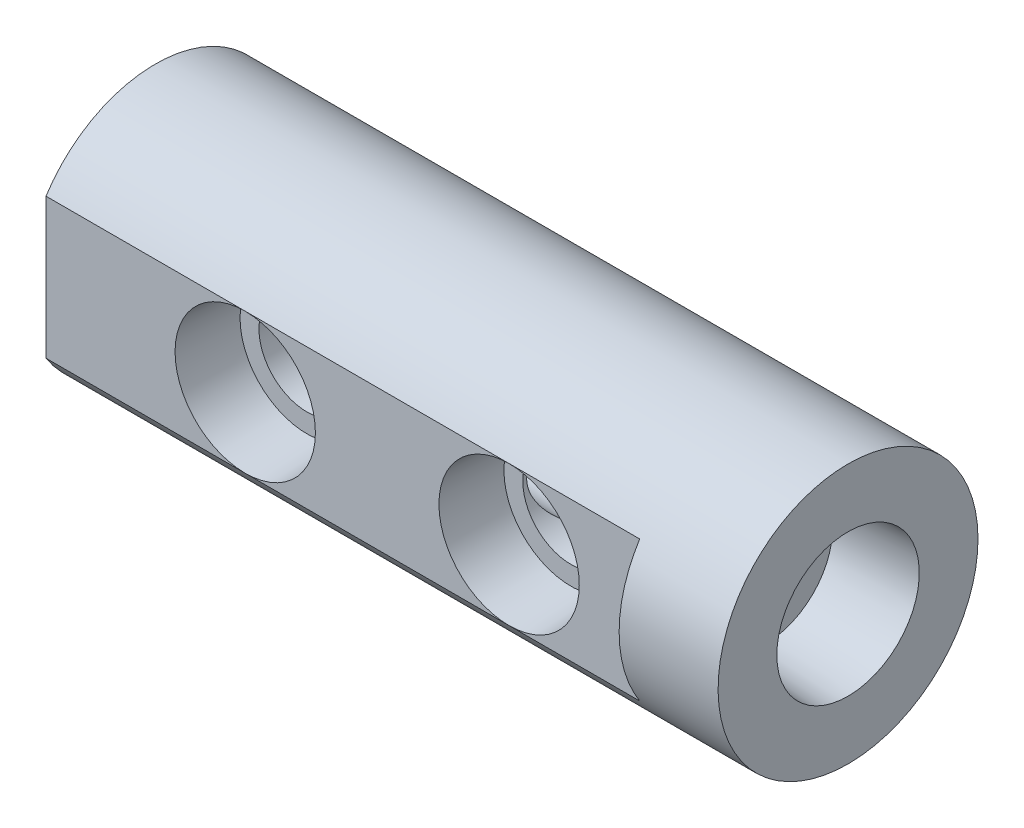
ISO-10303-21;
HEADER;
FILE_DESCRIPTION(('STEP AP214'),'2;1');
FILE_NAME('part.step','',(''),(''),'','','');
FILE_SCHEMA(('AUTOMOTIVE_DESIGN { 1 0 10303 214 1 1 1 1 }'));
ENDSEC;
DATA;
#1=APPLICATION_CONTEXT('core data for automotive mechanical design processes');
#2=APPLICATION_PROTOCOL_DEFINITION('international standard','automotive_design',2000,#1);
#3=PRODUCT_CONTEXT('',#1,'mechanical');
#4=PRODUCT('Part','Part','',(#3));
#5=PRODUCT_RELATED_PRODUCT_CATEGORY('part','',(#4));
#6=PRODUCT_DEFINITION_FORMATION('','',#4);
#7=PRODUCT_DEFINITION_CONTEXT('part definition',#1,'design');
#8=PRODUCT_DEFINITION('design','',#6,#7);
#9=PRODUCT_DEFINITION_SHAPE('','',#8);
#10=(LENGTH_UNIT() NAMED_UNIT(*) SI_UNIT(.MILLI.,.METRE.));
#11=(NAMED_UNIT(*) PLANE_ANGLE_UNIT() SI_UNIT($,.RADIAN.));
#12=(NAMED_UNIT(*) SI_UNIT($,.STERADIAN.) SOLID_ANGLE_UNIT());
#13=UNCERTAINTY_MEASURE_WITH_UNIT(LENGTH_MEASURE(1.E-05),#10,'distance_accuracy_value','');
#14=(GEOMETRIC_REPRESENTATION_CONTEXT(3) GLOBAL_UNCERTAINTY_ASSIGNED_CONTEXT((#13)) GLOBAL_UNIT_ASSIGNED_CONTEXT((#10,
#11,#12)) REPRESENTATION_CONTEXT('',''));
#15=CARTESIAN_POINT('',(0.,0.,0.));
#16=DIRECTION('',(0.,0.,1.));
#17=DIRECTION('',(1.,0.,0.));
#18=AXIS2_PLACEMENT_3D('',#15,#16,#17);
#19=CARTESIAN_POINT('',(44.577,0.,17.0942));
#20=DIRECTION('',(0.,0.,-1.));
#21=DIRECTION('',(-1.,0.,0.));
#22=AXIS2_PLACEMENT_3D('',#19,#20,#21);
#23=CYLINDRICAL_SURFACE('',#22,4.6228);
#24=CARTESIAN_POINT('',(44.577,0.,17.0942));
#25=DIRECTION('',(0.,0.,-1.));
#26=DIRECTION('',(-1.,0.,0.));
#27=AXIS2_PLACEMENT_3D('',#24,#25,#26);
#28=CIRCLE('',#27,4.6228);
#29=CARTESIAN_POINT('',(39.9542,0.,17.0942));
#30=VERTEX_POINT('',#29);
#31=EDGE_CURVE('E204',#30,#30,#28,.T.);
#32=ORIENTED_EDGE('',*,*,#31,.F.);
#33=EDGE_LOOP('',(#32));
#34=FACE_BOUND('',#33,.T.);
#35=CARTESIAN_POINT('',(44.577,0.,5.46297482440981));
#36=DIRECTION('',(0.,0.,-1.));
#37=DIRECTION('',(-1.,0.,0.));
#38=AXIS2_PLACEMENT_3D('',#35,#36,#37);
#39=CIRCLE('',#38,4.6228);
#40=CARTESIAN_POINT('',(39.9542,0.,5.46297482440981));
#41=VERTEX_POINT('',#40);
#42=EDGE_CURVE('E201',#41,#41,#39,.T.);
#43=ORIENTED_EDGE('',*,*,#42,.T.);
#44=EDGE_LOOP('',(#43));
#45=FACE_BOUND('',#44,.T.);
#46=CARTESIAN_POINT('',(49.1998,0.,16.4719));
#47=CARTESIAN_POINT('',(49.1998041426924,-0.0933276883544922,16.4719042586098));
#48=CARTESIAN_POINT('',(49.1969702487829,-0.186622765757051,16.468599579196));
#49=CARTESIAN_POINT('',(49.1857114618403,-0.372441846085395,16.4554558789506));
#50=CARTESIAN_POINT('',(49.177285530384,-0.464965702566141,16.4456156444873));
#51=CARTESIAN_POINT('',(49.1550211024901,-0.648500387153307,16.4195712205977));
#52=CARTESIAN_POINT('',(49.1411796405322,-0.739510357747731,16.4033635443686));
#53=CARTESIAN_POINT('',(49.1083918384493,-0.919314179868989,16.364878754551));
#54=CARTESIAN_POINT('',(49.089443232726,-1.00810702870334,16.3425989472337));
#55=CARTESIAN_POINT('',(49.0257650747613,-1.26909209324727,16.267499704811));
#56=CARTESIAN_POINT('',(48.9740299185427,-1.43725022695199,16.2062200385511));
#57=CARTESIAN_POINT('',(48.8554464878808,-1.75918975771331,16.0643471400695));
#58=CARTESIAN_POINT('',(48.7885932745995,-1.91296643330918,15.9837475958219));
#59=CARTESIAN_POINT('',(48.6157784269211,-2.26031069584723,15.7724916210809));
#60=CARTESIAN_POINT('',(48.5046014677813,-2.44684451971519,15.6344447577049));
#61=CARTESIAN_POINT('',(48.3283802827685,-2.70338765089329,15.4087027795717));
#62=CARTESIAN_POINT('',(48.2679458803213,-2.78515259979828,15.3301843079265));
#63=CARTESIAN_POINT('',(48.1450251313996,-2.94096818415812,15.1673187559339));
#64=CARTESIAN_POINT('',(48.0825395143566,-3.01502152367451,15.0829737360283));
#65=CARTESIAN_POINT('',(47.955418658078,-3.15686985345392,14.9069635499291));
#66=CARTESIAN_POINT('',(47.8907655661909,-3.22450645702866,14.8151841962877));
#67=CARTESIAN_POINT('',(47.7619422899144,-3.35180828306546,14.6258673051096));
#68=CARTESIAN_POINT('',(47.6977722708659,-3.41147088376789,14.5283278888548));
#69=CARTESIAN_POINT('',(47.5718027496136,-3.52256557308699,14.3275449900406));
#70=CARTESIAN_POINT('',(47.5099985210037,-3.57401480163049,14.2243140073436));
#71=CARTESIAN_POINT('',(47.3909463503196,-3.66848090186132,14.0116272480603));
#72=CARTESIAN_POINT('',(47.3336947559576,-3.71150457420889,13.9021765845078));
#73=CARTESIAN_POINT('',(47.2238333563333,-3.79069612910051,13.6701518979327));
#74=CARTESIAN_POINT('',(47.171663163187,-3.82634502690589,13.5471861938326));
#75=CARTESIAN_POINT('',(47.0811127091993,-3.88621640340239,13.2935853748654));
#76=CARTESIAN_POINT('',(47.0427042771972,-3.91046225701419,13.1629665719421));
#77=CARTESIAN_POINT('',(46.9997205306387,-3.93712986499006,12.961525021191));
#78=CARTESIAN_POINT('',(46.9877956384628,-3.94442053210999,12.8928836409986));
#79=CARTESIAN_POINT('',(46.9697060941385,-3.95542063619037,12.7545784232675));
#80=CARTESIAN_POINT('',(46.9635381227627,-3.95913213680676,12.6849151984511));
#81=CARTESIAN_POINT('',(46.9573537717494,-3.96285378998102,12.5452577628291));
#82=CARTESIAN_POINT('',(46.9573333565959,-3.96286637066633,12.4752637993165));
#83=CARTESIAN_POINT('',(46.9634224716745,-3.95920143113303,12.3356574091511));
#84=CARTESIAN_POINT('',(46.9695319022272,-3.95552397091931,12.2660449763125));
#85=CARTESIAN_POINT('',(46.9937528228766,-3.94080234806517,12.0800874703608));
#86=CARTESIAN_POINT('',(47.0172399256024,-3.92642414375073,11.9646793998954));
#87=CARTESIAN_POINT('',(47.0773068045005,-3.88844100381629,11.7388974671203));
#88=CARTESIAN_POINT('',(47.1139096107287,-3.86481983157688,11.6285328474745));
#89=CARTESIAN_POINT('',(47.1927368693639,-3.81185731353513,11.4229364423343));
#90=CARTESIAN_POINT('',(47.2341920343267,-3.78319499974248,11.3272245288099));
#91=CARTESIAN_POINT('',(47.3224268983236,-3.71965965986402,11.1403784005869));
#92=CARTESIAN_POINT('',(47.3692107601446,-3.68478176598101,11.049247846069));
#93=CARTESIAN_POINT('',(47.4663386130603,-3.60912775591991,10.8711494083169));
#94=CARTESIAN_POINT('',(47.516690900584,-3.56833764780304,10.7841920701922));
#95=CARTESIAN_POINT('',(47.6194276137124,-3.48115718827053,10.6144381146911));
#96=CARTESIAN_POINT('',(47.671811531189,-3.4347682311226,10.5316404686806));
#97=CARTESIAN_POINT('',(47.7818006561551,-3.33250886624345,10.3634688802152));
#98=CARTESIAN_POINT('',(47.8394855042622,-3.27617506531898,10.2784281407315));
#99=CARTESIAN_POINT('',(47.9548345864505,-3.15711868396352,10.1129173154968));
#100=CARTESIAN_POINT('',(48.0124988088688,-3.09439415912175,10.0324486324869));
#101=CARTESIAN_POINT('',(48.1838403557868,-2.8967733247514,9.79821993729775));
#102=CARTESIAN_POINT('',(48.2960855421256,-2.75223321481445,9.6513136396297));
#103=CARTESIAN_POINT('',(48.5042419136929,-2.4453508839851,9.38540526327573));
#104=CARTESIAN_POINT('',(48.6006912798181,-2.28427348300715,9.26536980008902));
#105=CARTESIAN_POINT('',(48.7777653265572,-1.93940182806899,9.04818299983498));
#106=CARTESIAN_POINT('',(48.8584051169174,-1.75562954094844,8.95100979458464));
#107=CARTESIAN_POINT('',(48.9852596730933,-1.40224347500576,8.79944967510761));
#108=CARTESIAN_POINT('',(49.0350394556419,-1.23586512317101,8.74053656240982));
#109=CARTESIAN_POINT('',(49.1162338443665,-0.892559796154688,8.64483635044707));
#110=CARTESIAN_POINT('',(49.1476619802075,-0.715640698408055,8.60803295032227));
#111=CARTESIAN_POINT('',(49.1897259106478,-0.35510981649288,8.55883683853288));
#112=CARTESIAN_POINT('',(49.2002662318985,-0.171471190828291,8.54655621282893));
#113=CARTESIAN_POINT('',(49.1993020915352,0.195673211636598,8.54768074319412));
#114=CARTESIAN_POINT('',(49.1877985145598,0.379178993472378,8.56108486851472));
#115=CARTESIAN_POINT('',(49.1454219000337,0.726803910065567,8.61065923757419));
#116=CARTESIAN_POINT('',(49.1160235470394,0.891360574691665,8.6450968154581));
#117=CARTESIAN_POINT('',(49.0412844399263,1.21139111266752,8.73316432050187));
#118=CARTESIAN_POINT('',(48.9959411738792,1.3668635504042,8.78679727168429));
#119=CARTESIAN_POINT('',(48.8877912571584,1.67830627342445,8.9158120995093));
#120=CARTESIAN_POINT('',(48.8238669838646,1.83329539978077,8.99260450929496));
#121=CARTESIAN_POINT('',(48.6840860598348,2.12809172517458,9.16273268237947));
#122=CARTESIAN_POINT('',(48.6082202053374,2.26788707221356,9.25608121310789));
#123=CARTESIAN_POINT('',(48.4679129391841,2.49891198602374,9.43190329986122));
#124=CARTESIAN_POINT('',(48.4052885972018,2.59360032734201,9.51135379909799));
#125=CARTESIAN_POINT('',(48.2766701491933,2.77398353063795,9.67742334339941));
#126=CARTESIAN_POINT('',(48.2106758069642,2.85967776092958,9.76404289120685));
#127=CARTESIAN_POINT('',(48.0766068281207,3.0222775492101,9.94411377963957));
#128=CARTESIAN_POINT('',(48.0085278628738,3.09916299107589,10.0375799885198));
#129=CARTESIAN_POINT('',(47.871986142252,3.2439536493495,10.2309120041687));
#130=CARTESIAN_POINT('',(47.8035235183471,3.31186176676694,10.3307757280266));
#131=CARTESIAN_POINT('',(47.6835266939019,3.42416389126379,10.5133971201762));
#132=CARTESIAN_POINT('',(47.631700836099,3.47038424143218,10.5948456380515));
#133=CARTESIAN_POINT('',(47.5299552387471,3.55735990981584,10.7617416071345));
#134=CARTESIAN_POINT('',(47.4800350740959,3.59811645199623,10.8471881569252));
#135=CARTESIAN_POINT('',(47.3835258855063,3.67388691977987,11.0221416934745));
#136=CARTESIAN_POINT('',(47.3369295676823,3.70891365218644,11.1116390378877));
#137=CARTESIAN_POINT('',(47.2487089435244,3.77295927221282,11.2950760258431));
#138=CARTESIAN_POINT('',(47.2070815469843,3.80198190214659,11.3890128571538));
#139=CARTESIAN_POINT('',(47.1225354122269,3.85923280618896,11.6029866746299));
#140=CARTESIAN_POINT('',(47.0813830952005,3.88585316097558,11.724186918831));
#141=CARTESIAN_POINT('',(47.0149714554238,3.92786878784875,11.9726161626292));
#142=CARTESIAN_POINT('',(46.9896713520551,3.94329287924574,12.099828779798));
#143=CARTESIAN_POINT('',(46.9593711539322,3.96168578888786,12.3590215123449));
#144=CARTESIAN_POINT('',(46.954577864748,3.96452772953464,12.4910367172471));
#145=CARTESIAN_POINT('',(46.9669807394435,3.9570569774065,12.7536862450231));
#146=CARTESIAN_POINT('',(46.9841978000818,3.9467317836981,12.8843191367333));
#147=CARTESIAN_POINT('',(47.0420086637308,3.91092306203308,13.1644076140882));
#148=CARTESIAN_POINT('',(47.0864311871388,3.88292640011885,13.3127077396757));
#149=CARTESIAN_POINT('',(47.1923368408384,3.81238851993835,13.5995921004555));
#150=CARTESIAN_POINT('',(47.2538806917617,3.7697954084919,13.7381395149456));
#151=CARTESIAN_POINT('',(47.3758820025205,3.67985627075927,13.9837646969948));
#152=CARTESIAN_POINT('',(47.4348865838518,3.63441151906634,14.0922946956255));
#153=CARTESIAN_POINT('',(47.5568527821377,3.53510160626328,14.3031733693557));
#154=CARTESIAN_POINT('',(47.6198168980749,3.4812310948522,14.4055180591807));
#155=CARTESIAN_POINT('',(47.7475918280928,3.36527687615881,14.6044446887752));
#156=CARTESIAN_POINT('',(47.8124050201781,3.30318218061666,14.7010186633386));
#157=CARTESIAN_POINT('',(47.9421278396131,3.17092666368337,14.8883609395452));
#158=CARTESIAN_POINT('',(48.0070374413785,3.10076769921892,14.9791305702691));
#159=CARTESIAN_POINT('',(48.1387212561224,2.94873250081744,15.1590523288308));
#160=CARTESIAN_POINT('',(48.2054322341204,2.86645192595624,15.2479101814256));
#161=CARTESIAN_POINT('',(48.336028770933,2.69291307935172,15.4187367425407));
#162=CARTESIAN_POINT('',(48.3999137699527,2.60165304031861,15.5007040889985));
#163=CARTESIAN_POINT('',(48.5232995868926,2.41037681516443,15.6568634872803));
#164=CARTESIAN_POINT('',(48.5828104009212,2.31038181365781,15.7310734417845));
#165=CARTESIAN_POINT('',(48.6961480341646,2.10166643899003,15.8709566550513));
#166=CARTESIAN_POINT('',(48.7499777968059,1.99295063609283,15.9366343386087));
#167=CARTESIAN_POINT('',(48.86972788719,1.7239232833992,16.0816288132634));
#168=CARTESIAN_POINT('',(48.9324266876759,1.55975023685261,16.1565905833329));
#169=CARTESIAN_POINT('',(49.0401198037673,1.21772298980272,16.284545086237));
#170=CARTESIAN_POINT('',(49.0851426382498,1.03989138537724,16.3375732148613));
#171=CARTESIAN_POINT('',(49.1458608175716,0.718247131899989,16.4088686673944));
#172=CARTESIAN_POINT('',(49.1659873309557,0.576420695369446,16.4324071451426));
#173=CARTESIAN_POINT('',(49.1929541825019,0.289703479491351,16.4639200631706));
#174=CARTESIAN_POINT('',(49.1997935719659,0.144812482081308,16.4718933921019));
#175=CARTESIAN_POINT('',(49.1998,0.,16.4719));
#176=B_SPLINE_CURVE_WITH_KNOTS('',3,(#46,#47,#48,#49,#50,#51,#52,#53,#54,#55,#56,#57,#58,#59,
#60,#61,#62,#63,#64,#65,#66,#67,#68,#69,#70,#71,#72,#73,#74,#75,#76,#77,#78,#79,#80,#81,#82,#83,
#84,#85,#86,#87,#88,#89,#90,#91,#92,#93,#94,#95,#96,#97,#98,#99,#100,#101,#102,#103,#104,#105,
#106,#107,#108,#109,#110,#111,#112,#113,#114,#115,#116,#117,#118,#119,#120,#121,#122,#123,#124,
#125,#126,#127,#128,#129,#130,#131,#132,#133,#134,#135,#136,#137,#138,#139,#140,#141,#142,#143,
#144,#145,#146,#147,#148,#149,#150,#151,#152,#153,#154,#155,#156,#157,#158,#159,#160,#161,#162,
#163,#164,#165,#166,#167,#168,#169,#170,#171,#172,#173,#174,#175),.UNSPECIFIED.,.T.,.F.,(4,2,2,
2,2,2,2,2,2,2,2,2,2,2,2,2,2,2,2,2,2,2,2,2,2,2,2,2,2,2,2,2,2,2,2,2,2,2,2,2,2,2,2,2,2,2,2,2,2,2,2,
2,2,2,2,2,2,2,2,2,2,2,2,2,4),(0.,0.279825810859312,0.559703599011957,0.839734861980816,
1.11989055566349,1.67610186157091,2.23249513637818,2.9999489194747,3.38507302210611,
3.77006162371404,4.16289977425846,4.55586676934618,4.94800267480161,5.33982075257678,
5.75358528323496,6.16649790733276,6.37636019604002,6.58610141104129,6.79570494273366,
7.00530506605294,7.35969922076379,7.71471873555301,8.03875813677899,8.36305243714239,
8.68812714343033,9.01312106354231,9.36439889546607,9.71578392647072,10.4172520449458,
11.0833566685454,11.7488215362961,12.2967074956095,12.8441890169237,13.3941672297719,
13.9441233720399,14.4539480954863,14.9638531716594,15.5150900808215,16.0667539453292,
16.4819367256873,16.8971486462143,17.3132906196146,17.7292977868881,18.0501923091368,
18.3710148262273,18.6911101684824,19.0110053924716,19.4019459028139,19.7918765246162,
20.18573035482,20.5799583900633,21.0492930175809,21.5203138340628,21.9146873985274,
22.3093124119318,22.7044701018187,23.0995369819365,23.5138521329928,23.9282489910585,
24.3416673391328,24.7548704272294,25.3257044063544,25.8956135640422,26.3297760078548,
26.763969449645),.UNSPECIFIED.);
#177=CARTESIAN_POINT('',(49.1998,0.,16.4719));
#178=VERTEX_POINT('',#177);
#179=EDGE_CURVE('E188',#178,#178,#176,.T.);
#180=ORIENTED_EDGE('',*,*,#179,.T.);
#181=EDGE_LOOP('',(#180));
#182=FACE_BOUND('',#181,.T.);
#183=CARTESIAN_POINT('',(39.9542,0.,16.7259));
#184=CARTESIAN_POINT('',(39.9541999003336,0.0973083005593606,16.7259001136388));
#185=CARTESIAN_POINT('',(39.9572787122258,0.194619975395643,16.7225252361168));
#186=CARTESIAN_POINT('',(39.9695218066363,0.388397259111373,16.7090966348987));
#187=CARTESIAN_POINT('',(39.9786865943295,0.484862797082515,16.6990423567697));
#188=CARTESIAN_POINT('',(40.0029032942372,0.676176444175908,16.6724485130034));
#189=CARTESIAN_POINT('',(40.0179569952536,0.771024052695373,16.6559069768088));
#190=CARTESIAN_POINT('',(40.0536271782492,0.958381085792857,16.6166542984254));
#191=CARTESIAN_POINT('',(40.0742461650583,1.05088943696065,16.5939403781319));
#192=CARTESIAN_POINT('',(40.143560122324,1.32272277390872,16.5174436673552));
#193=CARTESIAN_POINT('',(40.1999039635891,1.49780125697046,16.4550966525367));
#194=CARTESIAN_POINT('',(40.329277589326,1.83290831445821,16.3110634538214));
#195=CARTESIAN_POINT('',(40.4023146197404,1.99293031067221,16.2293688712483));
#196=CARTESIAN_POINT('',(40.593269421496,2.35747227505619,16.0139692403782));
#197=CARTESIAN_POINT('',(40.7174548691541,2.55419595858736,15.872529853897));
#198=CARTESIAN_POINT('',(40.9157397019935,2.82454578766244,15.6422434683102));
#199=CARTESIAN_POINT('',(40.9839543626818,2.91065744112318,15.562317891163));
#200=CARTESIAN_POINT('',(41.123380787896,3.07479441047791,15.3969246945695));
#201=CARTESIAN_POINT('',(41.1945921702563,3.15282075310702,15.3114577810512));
#202=CARTESIAN_POINT('',(41.3406693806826,3.30267514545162,15.1332861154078));
#203=CARTESIAN_POINT('',(41.4155819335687,3.37430790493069,15.0404563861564));
#204=CARTESIAN_POINT('',(41.5662011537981,3.50935810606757,14.8496069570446));
#205=CARTESIAN_POINT('',(41.6419078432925,3.57277531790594,14.7515871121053));
#206=CARTESIAN_POINT('',(41.7925406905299,3.6913729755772,14.5504334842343));
#207=CARTESIAN_POINT('',(41.8674679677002,3.74656741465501,14.447308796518));
#208=CARTESIAN_POINT('',(42.0147462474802,3.84878603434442,14.2353944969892));
#209=CARTESIAN_POINT('',(42.087098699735,3.89581487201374,14.1266081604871));
#210=CARTESIAN_POINT('',(42.2252908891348,3.98072817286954,13.9043993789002));
#211=CARTESIAN_POINT('',(42.291221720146,4.01875690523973,13.7910898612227));
#212=CARTESIAN_POINT('',(42.4138138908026,4.08604631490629,13.5569186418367));
#213=CARTESIAN_POINT('',(42.4704781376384,4.11530974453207,13.4360593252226));
#214=CARTESIAN_POINT('',(42.5596497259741,4.15964479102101,13.2070453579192));
#215=CARTESIAN_POINT('',(42.5946201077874,4.17627809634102,13.1001893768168));
#216=CARTESIAN_POINT('',(42.6483538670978,4.20137041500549,12.8816822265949));
#217=CARTESIAN_POINT('',(42.6671707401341,4.20985642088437,12.7700481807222));
#218=CARTESIAN_POINT('',(42.6847372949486,4.21778955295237,12.5437389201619));
#219=CARTESIAN_POINT('',(42.6833022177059,4.21715345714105,12.4290452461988));
#220=CARTESIAN_POINT('',(42.6602553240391,4.20672020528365,12.2020518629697));
#221=CARTESIAN_POINT('',(42.6385996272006,4.19690312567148,12.0897579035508));
#222=CARTESIAN_POINT('',(42.5701942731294,4.16470823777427,11.835224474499));
#223=CARTESIAN_POINT('',(42.5175997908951,4.13929819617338,11.6950234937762));
#224=CARTESIAN_POINT('',(42.3964123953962,4.07676063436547,11.4243728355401));
#225=CARTESIAN_POINT('',(42.3277548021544,4.03958552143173,11.2939654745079));
#226=CARTESIAN_POINT('',(42.1834179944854,3.95574289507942,11.0442047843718));
#227=CARTESIAN_POINT('',(42.1079070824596,3.90928055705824,10.9246822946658));
#228=CARTESIAN_POINT('',(41.9527929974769,3.8068982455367,10.6924504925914));
#229=CARTESIAN_POINT('',(41.8731864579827,3.75097040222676,10.5797469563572));
#230=CARTESIAN_POINT('',(41.7124703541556,3.6297256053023,10.3603509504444));
#231=CARTESIAN_POINT('',(41.6313587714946,3.56439510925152,10.2536674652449));
#232=CARTESIAN_POINT('',(41.4696703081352,3.42435745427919,10.0462803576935));
#233=CARTESIAN_POINT('',(41.3890932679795,3.34965323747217,9.945574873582));
#234=CARTESIAN_POINT('',(41.2247698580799,3.1854660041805,9.74384728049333));
#235=CARTESIAN_POINT('',(41.14116186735,3.09533529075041,9.64323696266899));
#236=CARTESIAN_POINT('',(40.9779546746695,2.90395917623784,9.44950099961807));
#237=CARTESIAN_POINT('',(40.8983566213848,2.80271061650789,9.35637749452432));
#238=CARTESIAN_POINT('',(40.7451542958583,2.58929025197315,9.17891656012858));
#239=CARTESIAN_POINT('',(40.6715313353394,2.47715512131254,9.09455148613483));
#240=CARTESIAN_POINT('',(40.5318753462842,2.24186863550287,8.9356767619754));
#241=CARTESIAN_POINT('',(40.4658368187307,2.11872537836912,8.86115996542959));
#242=CARTESIAN_POINT('',(40.3277314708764,1.82912826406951,8.70613692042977));
#243=CARTESIAN_POINT('',(40.2583426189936,1.65958255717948,8.62885736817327));
#244=CARTESIAN_POINT('',(40.1685475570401,1.39447953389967,8.52924832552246));
#245=CARTESIAN_POINT('',(40.1409930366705,1.30429476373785,8.4987590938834));
#246=CARTESIAN_POINT('',(40.0911101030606,1.12075694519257,8.44365498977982));
#247=CARTESIAN_POINT('',(40.0687792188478,1.02740541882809,8.41903733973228));
#248=CARTESIAN_POINT('',(40.029630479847,0.837374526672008,8.37593006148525));
#249=CARTESIAN_POINT('',(40.0128563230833,0.740675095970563,8.35748899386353));
#250=CARTESIAN_POINT('',(39.9854295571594,0.545411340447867,8.32735852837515));
#251=CARTESIAN_POINT('',(39.9747741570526,0.446847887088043,8.31566605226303));
#252=CARTESIAN_POINT('',(39.9598240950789,0.248674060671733,8.29926558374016));
#253=CARTESIAN_POINT('',(39.955528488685,0.149063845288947,8.29455655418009));
#254=CARTESIAN_POINT('',(39.9533990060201,-0.0503028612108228,8.29222178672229));
#255=CARTESIAN_POINT('',(39.9555645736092,-0.150059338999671,8.29459543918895));
#256=CARTESIAN_POINT('',(39.9657333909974,-0.338248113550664,8.3057476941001));
#257=CARTESIAN_POINT('',(39.9730924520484,-0.426758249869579,8.3138195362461));
#258=CARTESIAN_POINT('',(39.9927831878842,-0.602557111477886,8.33543580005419));
#259=CARTESIAN_POINT('',(40.0051164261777,-0.689845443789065,8.34898194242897));
#260=CARTESIAN_POINT('',(40.0492651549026,-0.948946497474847,8.39752727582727));
#261=CARTESIAN_POINT('',(40.0882388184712,-1.11815477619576,8.44044333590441));
#262=CARTESIAN_POINT('',(40.1840699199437,-1.45025077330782,8.54640647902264));
#263=CARTESIAN_POINT('',(40.2414006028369,-1.61282577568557,8.6099870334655));
#264=CARTESIAN_POINT('',(40.3703343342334,-1.92423896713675,8.75386509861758));
#265=CARTESIAN_POINT('',(40.4419437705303,-2.07307096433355,8.83417009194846));
#266=CARTESIAN_POINT('',(40.6355250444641,-2.42774944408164,9.05308172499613));
#267=CARTESIAN_POINT('',(40.7646300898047,-2.62427304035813,9.20061184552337));
#268=CARTESIAN_POINT('',(40.9699213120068,-2.89346143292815,9.44022611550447));
#269=CARTESIAN_POINT('',(41.0404317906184,-2.97905908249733,9.52332132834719));
#270=CARTESIAN_POINT('',(41.1842627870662,-3.14187595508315,9.69513816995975));
#271=CARTESIAN_POINT('',(41.2575828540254,-3.21909651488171,9.78385889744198));
#272=CARTESIAN_POINT('',(41.4076358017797,-3.36701329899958,9.96871141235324));
#273=CARTESIAN_POINT('',(41.48440837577,-3.43751045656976,10.0649693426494));
#274=CARTESIAN_POINT('',(41.6383706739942,-3.57002072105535,10.2629089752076));
#275=CARTESIAN_POINT('',(41.7155605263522,-3.63203104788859,10.3645924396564));
#276=CARTESIAN_POINT('',(41.8685102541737,-3.74746811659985,10.5733405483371));
#277=CARTESIAN_POINT('',(41.944272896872,-3.8009134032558,10.6803928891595));
#278=CARTESIAN_POINT('',(42.0922401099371,-3.89924544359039,10.9006324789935));
#279=CARTESIAN_POINT('',(42.1644473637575,-3.94413872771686,11.0138149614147));
#280=CARTESIAN_POINT('',(42.2963170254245,-4.021707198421,11.2379636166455));
#281=CARTESIAN_POINT('',(42.3565219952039,-4.05507858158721,11.3483632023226));
#282=CARTESIAN_POINT('',(42.4667544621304,-4.11351695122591,11.576319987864));
#283=CARTESIAN_POINT('',(42.5167913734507,-4.13859163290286,11.6938704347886));
#284=CARTESIAN_POINT('',(42.593275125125,-4.17571957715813,11.9163087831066));
#285=CARTESIAN_POINT('',(42.6222638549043,-4.18924664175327,12.0200413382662));
#286=CARTESIAN_POINT('',(42.664141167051,-4.20854046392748,12.2313077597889));
#287=CARTESIAN_POINT('',(42.6770742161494,-4.21432865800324,12.3388302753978));
#288=CARTESIAN_POINT('',(42.6842208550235,-4.21754591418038,12.555240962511));
#289=CARTESIAN_POINT('',(42.6783347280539,-4.21493044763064,12.6641333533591));
#290=CARTESIAN_POINT('',(42.6489438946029,-4.20156066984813,12.8790740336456));
#291=CARTESIAN_POINT('',(42.6253988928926,-4.19078774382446,12.9851152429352));
#292=CARTESIAN_POINT('',(42.5511976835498,-4.15556283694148,13.2392236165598));
#293=CARTESIAN_POINT('',(42.4930808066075,-4.12711750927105,13.3844644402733));
#294=CARTESIAN_POINT('',(42.3609532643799,-4.05771068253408,13.6644873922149));
#295=CARTESIAN_POINT('',(42.2868742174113,-4.01669500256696,13.7992210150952));
#296=CARTESIAN_POINT('',(42.1329847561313,-3.92490642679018,14.0558154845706));
#297=CARTESIAN_POINT('',(42.0534127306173,-3.87446289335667,14.1779411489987));
#298=CARTESIAN_POINT('',(41.8906991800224,-3.7634809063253,14.41512241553));
#299=CARTESIAN_POINT('',(41.8075547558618,-3.70293413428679,14.5301720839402));
#300=CARTESIAN_POINT('',(41.6404140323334,-3.57183920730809,14.7537767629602));
#301=CARTESIAN_POINT('',(41.5564176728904,-3.50129034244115,14.8623313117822));
#302=CARTESIAN_POINT('',(41.389563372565,-3.35010513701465,15.0730185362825));
#303=CARTESIAN_POINT('',(41.306704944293,-3.26947327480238,15.1751540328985));
#304=CARTESIAN_POINT('',(41.1545623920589,-3.10929601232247,15.3596165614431));
#305=CARTESIAN_POINT('',(41.0849381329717,-3.03103136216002,15.4427718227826));
#306=CARTESIAN_POINT('',(40.9487607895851,-2.86663189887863,15.6036392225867));
#307=CARTESIAN_POINT('',(40.8822085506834,-2.78049493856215,15.6813498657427));
#308=CARTESIAN_POINT('',(40.6889458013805,-2.5104053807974,15.9051452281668));
#309=CARTESIAN_POINT('',(40.5682047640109,-2.31434143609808,16.0423999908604));
#310=CARTESIAN_POINT('',(40.3777713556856,-1.94154967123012,16.2569060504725));
#311=CARTESIAN_POINT('',(40.3027638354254,-1.77126946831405,16.3406674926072));
#312=CARTESIAN_POINT('',(40.1718864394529,-1.41463824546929,16.486156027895));
#313=CARTESIAN_POINT('',(40.1159954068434,-1.22830527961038,16.5479074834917));
#314=CARTESIAN_POINT('',(40.0334920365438,-0.8694537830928,16.6388493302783));
#315=CARTESIAN_POINT('',(40.0039497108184,-0.698455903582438,16.6713055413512));
#316=CARTESIAN_POINT('',(39.9742028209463,-0.438406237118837,16.7039615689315));
#317=CARTESIAN_POINT('',(39.9667148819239,-0.35109605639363,16.7121756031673));
#318=CARTESIAN_POINT('',(39.9567142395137,-0.175858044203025,16.7231439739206));
#319=CARTESIAN_POINT('',(39.9542000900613,-0.0879303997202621,16.7258998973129));
#320=CARTESIAN_POINT('',(39.9542,0.,16.7259));
#321=B_SPLINE_CURVE_WITH_KNOTS('',3,(#183,#184,#185,#186,#187,#188,#189,#190,#191,#192,#193,
#194,#195,#196,#197,#198,#199,#200,#201,#202,#203,#204,#205,#206,#207,#208,#209,#210,#211,#212,
#213,#214,#215,#216,#217,#218,#219,#220,#221,#222,#223,#224,#225,#226,#227,#228,#229,#230,#231,
#232,#233,#234,#235,#236,#237,#238,#239,#240,#241,#242,#243,#244,#245,#246,#247,#248,#249,#250,
#251,#252,#253,#254,#255,#256,#257,#258,#259,#260,#261,#262,#263,#264,#265,#266,#267,#268,#269,
#270,#271,#272,#273,#274,#275,#276,#277,#278,#279,#280,#281,#282,#283,#284,#285,#286,#287,#288,
#289,#290,#291,#292,#293,#294,#295,#296,#297,#298,#299,#300,#301,#302,#303,#304,#305,#306,#307,
#308,#309,#310,#311,#312,#313,#314,#315,#316,#317,#318,#319,#320),.UNSPECIFIED.,.T.,.F.,(4,2,2,
2,2,2,2,2,2,2,2,2,2,2,2,2,2,2,2,2,2,2,2,2,2,2,2,2,2,2,2,2,2,2,2,2,2,2,2,2,2,2,2,2,2,2,2,2,2,2,2,
2,2,2,2,2,2,2,2,2,2,2,2,2,2,2,2,2,4),(0.,0.291824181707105,0.583672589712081,0.875609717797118,
1.16767846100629,1.7474562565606,2.32748619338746,3.13947221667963,3.54676842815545,
3.95401285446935,4.37109610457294,4.78819101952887,5.20456782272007,5.62070636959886,
6.02963759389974,6.43844027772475,6.77824405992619,7.11691812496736,7.45868390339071,
7.80119306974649,8.25429547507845,8.70925474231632,9.15509587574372,9.60130952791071,
10.0481724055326,10.494895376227,10.9708952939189,11.4470307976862,11.9216145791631,
12.395852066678,12.9896563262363,13.2866808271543,13.5835645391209,13.8827303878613,
14.1817596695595,14.4807445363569,14.7797036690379,15.0469227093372,15.3142258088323,
15.8483577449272,16.397549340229,16.9469871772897,17.7748267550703,18.1902848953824,
18.6056766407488,19.030956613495,19.4563755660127,19.8808605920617,20.3050201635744,
20.6947303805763,21.0840781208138,21.4085275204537,21.732076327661,22.0573423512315,
22.3833528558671,22.8576680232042,23.3340570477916,23.7961648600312,24.25865504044,
24.7211780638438,25.1834963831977,25.5843501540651,25.9853135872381,26.7848946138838,
27.3947842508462,28.0039967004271,28.5311379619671,28.7949148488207,29.0586150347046),.UNSPECIFIED.);
#322=CARTESIAN_POINT('',(39.9542,0.,16.7259));
#323=VERTEX_POINT('',#322);
#324=EDGE_CURVE('E20',#323,#323,#321,.T.);
#325=ORIENTED_EDGE('',*,*,#324,.T.);
#326=EDGE_LOOP('',(#325));
#327=FACE_BOUND('',#326,.T.);
#328=ADVANCED_FACE('F16',(#34,#45,#182,#327),#23,.F.);
#329=CARTESIAN_POINT('',(46.6400387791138,0.,12.5095));
#330=DIRECTION('',(-1.,0.,0.));
#331=DIRECTION('',(0.,0.,1.));
#332=AXIS2_PLACEMENT_3D('',#329,#330,#331);
#333=CYLINDRICAL_SURFACE('',#332,2.921);
#334=CARTESIAN_POINT('',(23.7998,0.,15.4305));
#335=CARTESIAN_POINT('',(23.7997995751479,-0.0740995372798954,15.4304994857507));
#336=CARTESIAN_POINT('',(23.798012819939,-0.14820112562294,15.4276747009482));
#337=CARTESIAN_POINT('',(23.7909190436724,-0.295817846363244,15.4164271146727));
#338=CARTESIAN_POINT('',(23.7856105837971,-0.369332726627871,15.4080020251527));
#339=CARTESIAN_POINT('',(23.76454876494,-0.588303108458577,15.3744428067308));
#340=CARTESIAN_POINT('',(23.743659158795,-0.732103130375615,15.3410248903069));
#341=CARTESIAN_POINT('',(23.6902853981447,-1.01023033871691,15.2541062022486));
#342=CARTESIAN_POINT('',(23.6578585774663,-1.14460050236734,15.2007046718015));
#343=CARTESIAN_POINT('',(23.5841007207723,-1.40202449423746,15.0760196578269));
#344=CARTESIAN_POINT('',(23.5427703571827,-1.52507917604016,15.0047375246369));
#345=CARTESIAN_POINT('',(23.4506538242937,-1.76757495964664,14.8399774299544));
#346=CARTESIAN_POINT('',(23.3993736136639,-1.8859220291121,14.745172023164));
#347=CARTESIAN_POINT('',(23.2939854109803,-2.10609632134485,14.5391243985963));
#348=CARTESIAN_POINT('',(23.2398736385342,-2.20790067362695,14.4278598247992));
#349=CARTESIAN_POINT('',(23.1258991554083,-2.40651478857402,14.1739573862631));
#350=CARTESIAN_POINT('',(23.0662829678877,-2.50066187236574,14.029108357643));
#351=CARTESIAN_POINT('',(22.9569729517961,-2.66302216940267,13.7221675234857));
#352=CARTESIAN_POINT('',(22.9072623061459,-2.73127951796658,13.5601056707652));
#353=CARTESIAN_POINT('',(22.8371854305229,-2.8241413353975,13.2667817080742));
#354=CARTESIAN_POINT('',(22.81253637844,-2.85551420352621,13.138692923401));
#355=CARTESIAN_POINT('',(22.7765827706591,-2.90071461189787,12.877700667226));
#356=CARTESIAN_POINT('',(22.7652587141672,-2.91456779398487,12.7448045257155));
#357=CARTESIAN_POINT('',(22.7576676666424,-2.92389210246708,12.4775428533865));
#358=CARTESIAN_POINT('',(22.7614432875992,-2.91931120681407,12.3431742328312));
#359=CARTESIAN_POINT('',(22.7835350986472,-2.89196655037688,12.0774823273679));
#360=CARTESIAN_POINT('',(22.801863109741,-2.86918800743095,11.9461616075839));
#361=CARTESIAN_POINT('',(22.8497530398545,-2.80759986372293,11.6933262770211));
#362=CARTESIAN_POINT('',(22.8790113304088,-2.76922127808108,11.5716456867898));
#363=CARTESIAN_POINT('',(22.9455334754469,-2.67798714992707,11.3362208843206));
#364=CARTESIAN_POINT('',(22.9828001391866,-2.62512652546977,11.2224794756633));
#365=CARTESIAN_POINT('',(23.0696801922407,-2.49490266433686,10.9831905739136));
#366=CARTESIAN_POINT('',(23.1202943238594,-2.41479266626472,10.8595026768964));
#367=CARTESIAN_POINT('',(23.2235804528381,-2.23741331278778,10.6259518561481));
#368=CARTESIAN_POINT('',(23.2762545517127,-2.14012605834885,10.5161035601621));
#369=CARTESIAN_POINT('',(23.3883844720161,-1.91139316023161,10.2940011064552));
#370=CARTESIAN_POINT('',(23.4474415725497,-1.77695003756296,10.1846043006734));
#371=CARTESIAN_POINT('',(23.5564567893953,-1.48807336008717,9.98995700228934));
#372=CARTESIAN_POINT('',(23.6064180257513,-1.33364669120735,9.90469822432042));
#373=CARTESIAN_POINT('',(23.6691753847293,-1.0940982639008,9.79982978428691));
#374=CARTESIAN_POINT('',(23.6877164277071,-1.01513219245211,9.76924785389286));
#375=CARTESIAN_POINT('',(23.7209497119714,-0.854129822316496,9.71487874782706));
#376=CARTESIAN_POINT('',(23.7356441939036,-0.772095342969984,9.69108761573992));
#377=CARTESIAN_POINT('',(23.7607182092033,-0.605703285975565,9.65070929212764));
#378=CARTESIAN_POINT('',(23.7711018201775,-0.521347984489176,9.63411529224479));
#379=CARTESIAN_POINT('',(23.7872422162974,-0.351102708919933,9.6083984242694));
#380=CARTESIAN_POINT('',(23.792999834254,-0.265213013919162,9.59927421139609));
#381=CARTESIAN_POINT('',(23.801986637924,-0.0327789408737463,9.58502706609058));
#382=CARTESIAN_POINT('',(23.800684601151,0.11447320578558,9.58708098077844));
#383=CARTESIAN_POINT('',(23.7842470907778,0.40612207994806,9.61316102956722));
#384=CARTESIAN_POINT('',(23.7691127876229,0.550519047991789,9.63718530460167));
#385=CARTESIAN_POINT('',(23.7274158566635,0.826189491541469,9.70434372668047));
#386=CARTESIAN_POINT('',(23.7013805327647,0.957760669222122,9.74659858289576));
#387=CARTESIAN_POINT('',(23.6400686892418,1.21177288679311,9.84818828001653));
#388=CARTESIAN_POINT('',(23.6047906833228,1.33421245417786,9.90752586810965));
#389=CARTESIAN_POINT('',(23.5236041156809,1.57976519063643,10.0480879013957));
#390=CARTESIAN_POINT('',(23.4769863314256,1.70172830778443,10.1309047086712));
#391=CARTESIAN_POINT('',(23.3790987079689,1.93085609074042,10.31280353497));
#392=CARTESIAN_POINT('',(23.3278238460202,2.03800445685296,10.4119032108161));
#393=CARTESIAN_POINT('',(23.2167531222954,2.251032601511,10.6405367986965));
#394=CARTESIAN_POINT('',(23.1568250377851,2.35434921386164,10.7724051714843));
#395=CARTESIAN_POINT('',(23.042414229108,2.53782210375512,11.0535361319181));
#396=CARTESIAN_POINT('',(22.9879283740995,2.61799174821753,11.2027886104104));
#397=CARTESIAN_POINT('',(22.9019591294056,2.73848050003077,11.4841706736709));
#398=CARTESIAN_POINT('',(22.8680493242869,2.78360760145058,11.613488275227));
#399=CARTESIAN_POINT('',(22.8126538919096,2.85558908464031,11.8795939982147));
#400=CARTESIAN_POINT('',(22.7911484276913,2.88247265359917,12.0163698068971));
#401=CARTESIAN_POINT('',(22.7637599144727,2.91649612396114,12.2948692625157));
#402=CARTESIAN_POINT('',(22.7579758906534,2.92351088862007,12.4366186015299));
#403=CARTESIAN_POINT('',(22.7633744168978,2.91688369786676,12.7193305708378));
#404=CARTESIAN_POINT('',(22.7745610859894,2.90323672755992,12.8602930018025));
#405=CARTESIAN_POINT('',(22.8102223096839,2.85843900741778,13.1242160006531));
#406=CARTESIAN_POINT('',(22.833407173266,2.82897827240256,13.2476534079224));
#407=CARTESIAN_POINT('',(22.8893118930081,2.75520463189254,13.4876989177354));
#408=CARTESIAN_POINT('',(22.9220359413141,2.71088519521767,13.6043039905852));
#409=CARTESIAN_POINT('',(22.9989353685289,2.60156599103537,13.8451552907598));
#410=CARTESIAN_POINT('',(23.0440744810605,2.53453257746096,13.968164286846));
#411=CARTESIAN_POINT('',(23.1383548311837,2.38449312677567,14.202367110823));
#412=CARTESIAN_POINT('',(23.187499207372,2.30147449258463,14.3135515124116));
#413=CARTESIAN_POINT('',(23.2962355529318,2.10181834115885,14.5448241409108));
#414=CARTESIAN_POINT('',(23.35587912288,1.98177940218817,14.6619715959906));
#415=CARTESIAN_POINT('',(23.4696127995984,1.72158986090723,14.8752160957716));
#416=CARTESIAN_POINT('',(23.523698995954,1.58142526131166,14.9712983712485));
#417=CARTESIAN_POINT('',(23.596774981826,1.35727270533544,15.097462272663));
#418=CARTESIAN_POINT('',(23.6199160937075,1.27968175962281,15.1367206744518));
#419=CARTESIAN_POINT('',(23.6626990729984,1.12051627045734,15.208442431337));
#420=CARTESIAN_POINT('',(23.6823429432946,1.03894404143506,15.2409096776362));
#421=CARTESIAN_POINT('',(23.7174851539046,0.872629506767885,15.298493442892));
#422=CARTESIAN_POINT('',(23.7329943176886,0.787896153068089,15.3236291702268));
#423=CARTESIAN_POINT('',(23.7594175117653,0.615866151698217,15.366209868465));
#424=CARTESIAN_POINT('',(23.7703348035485,0.528571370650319,15.3836602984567));
#425=CARTESIAN_POINT('',(23.7857230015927,0.367805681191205,15.4081827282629));
#426=CARTESIAN_POINT('',(23.7909900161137,0.294603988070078,15.4165403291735));
#427=CARTESIAN_POINT('',(23.7980288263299,0.147602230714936,15.4276993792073));
#428=CARTESIAN_POINT('',(23.7998004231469,0.0738021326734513,15.4305005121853));
#429=CARTESIAN_POINT('',(23.7998,0.,15.4305));
#430=B_SPLINE_CURVE_WITH_KNOTS('',3,(#334,#335,#336,#337,#338,#339,#340,#341,#342,#343,#344,
#345,#346,#347,#348,#349,#350,#351,#352,#353,#354,#355,#356,#357,#358,#359,#360,#361,#362,#363,
#364,#365,#366,#367,#368,#369,#370,#371,#372,#373,#374,#375,#376,#377,#378,#379,#380,#381,#382,
#383,#384,#385,#386,#387,#388,#389,#390,#391,#392,#393,#394,#395,#396,#397,#398,#399,#400,#401,
#402,#403,#404,#405,#406,#407,#408,#409,#410,#411,#412,#413,#414,#415,#416,#417,#418,#419,#420,
#421,#422,#423,#424,#425,#426,#427,#428,#429),.UNSPECIFIED.,.T.,.F.,(4,2,2,2,2,2,2,2,2,2,2,2,2,
2,2,2,2,2,2,2,2,2,2,2,2,2,2,2,2,2,2,2,2,2,2,2,2,2,2,2,2,2,2,2,2,2,2,4),(0.,0.222219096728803,
0.444529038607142,0.889389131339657,1.33206869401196,1.77471483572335,2.2531018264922,
2.73214466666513,3.27779559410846,3.822512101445,4.22333006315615,4.62356070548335,
5.0249216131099,5.42660888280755,5.81788006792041,6.2092887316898,6.67502375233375,
7.14124697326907,7.68794215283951,8.23444945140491,8.49417636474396,8.75375164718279,
9.01308083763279,9.27236333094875,9.71167201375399,10.1509435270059,10.5710538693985,
10.9912318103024,11.4533041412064,11.9158808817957,12.4473166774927,12.9784449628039,
13.4000935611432,13.8210659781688,14.2446839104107,14.6684046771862,15.0539028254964,
15.439570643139,15.8795627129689,16.3199029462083,16.8516271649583,17.3837230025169,
17.6533320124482,17.9227861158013,18.1915277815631,18.4600782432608,18.6813928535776,
18.9027200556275),.UNSPECIFIED.);
#431=CARTESIAN_POINT('',(23.7998,0.,15.4305));
#432=VERTEX_POINT('',#431);
#433=EDGE_CURVE('E147',#432,#432,#430,.T.);
#434=ORIENTED_EDGE('',*,*,#433,.F.);
#435=EDGE_LOOP('',(#434));
#436=FACE_BOUND('',#435,.T.);
#437=CARTESIAN_POINT('',(29.083,0.,12.5095));
#438=DIRECTION('',(1.,0.,0.));
#439=DIRECTION('',(0.,0.,-1.));
#440=AXIS2_PLACEMENT_3D('',#437,#438,#439);
#441=CIRCLE('',#440,2.921);
#442=CARTESIAN_POINT('',(29.083,0.,9.5885));
#443=VERTEX_POINT('',#442);
#444=EDGE_CURVE('E695',#443,#443,#441,.T.);
#445=ORIENTED_EDGE('',*,*,#444,.T.);
#446=EDGE_LOOP('',(#445));
#447=FACE_BOUND('',#446,.T.);
#448=ADVANCED_FACE('F159',(#436,#447),#333,.F.);
#449=CARTESIAN_POINT('',(19.177,0.,17.0942));
#450=DIRECTION('',(0.,0.,-1.));
#451=DIRECTION('',(-1.,0.,0.));
#452=AXIS2_PLACEMENT_3D('',#449,#450,#451);
#453=CYLINDRICAL_SURFACE('',#452,4.6228);
#454=CARTESIAN_POINT('',(19.177,0.,17.0942));
#455=DIRECTION('',(0.,0.,-1.));
#456=DIRECTION('',(-1.,0.,0.));
#457=AXIS2_PLACEMENT_3D('',#454,#455,#456);
#458=CIRCLE('',#457,4.6228);
#459=CARTESIAN_POINT('',(14.5542,0.,17.0942));
#460=VERTEX_POINT('',#459);
#461=EDGE_CURVE('E213',#460,#460,#458,.T.);
#462=ORIENTED_EDGE('',*,*,#461,.F.);
#463=EDGE_LOOP('',(#462));
#464=FACE_BOUND('',#463,.T.);
#465=CARTESIAN_POINT('',(19.177,0.,5.46297482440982));
#466=DIRECTION('',(0.,0.,-1.));
#467=DIRECTION('',(-1.,0.,0.));
#468=AXIS2_PLACEMENT_3D('',#465,#466,#467);
#469=CIRCLE('',#468,4.6228);
#470=CARTESIAN_POINT('',(14.5542,0.,5.46297482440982));
#471=VERTEX_POINT('',#470);
#472=EDGE_CURVE('E210',#471,#471,#469,.T.);
#473=ORIENTED_EDGE('',*,*,#472,.T.);
#474=EDGE_LOOP('',(#473));
#475=FACE_BOUND('',#474,.T.);
#476=ORIENTED_EDGE('',*,*,#433,.T.);
#477=EDGE_LOOP('',(#476));
#478=FACE_BOUND('',#477,.T.);
#479=ADVANCED_FACE('F155',(#464,#475,#478),#453,.F.);
#480=CARTESIAN_POINT('',(58.7502,0.,6.06682116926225));
#481=DIRECTION('',(1.,0.,0.));
#482=DIRECTION('',(0.,0.,-1.));
#483=AXIS2_PLACEMENT_3D('',#480,#481,#482);
#484=PLANE('',#483);
#485=CARTESIAN_POINT('',(58.7502,0.,12.5095));
#486=DIRECTION('',(-1.,0.,0.));
#487=DIRECTION('',(0.,0.,1.));
#488=AXIS2_PLACEMENT_3D('',#485,#486,#487);
#489=CIRCLE('',#488,6.44267883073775);
#490=CARTESIAN_POINT('',(58.7502,0.,18.9521788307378));
#491=VERTEX_POINT('',#490);
#492=EDGE_CURVE('E198',#491,#491,#489,.T.);
#493=ORIENTED_EDGE('',*,*,#492,.F.);
#494=EDGE_LOOP('',(#493));
#495=FACE_BOUND('',#494,.T.);
#496=CARTESIAN_POINT('',(58.7502,0.,12.5095));
#497=DIRECTION('',(1.,0.,0.));
#498=DIRECTION('',(0.,0.,-1.));
#499=AXIS2_PLACEMENT_3D('',#496,#497,#498);
#500=CIRCLE('',#499,3.9624);
#501=CARTESIAN_POINT('',(58.7502,0.,8.5471));
#502=VERTEX_POINT('',#501);
#503=EDGE_CURVE('E138',#502,#502,#500,.F.);
#504=ORIENTED_EDGE('',*,*,#503,.T.);
#505=EDGE_LOOP('',(#504));
#506=FACE_BOUND('',#505,.T.);
#507=ADVANCED_FACE('F168',(#495,#506),#484,.T.);
#508=CARTESIAN_POINT('',(66.675,0.,12.5095));
#509=DIRECTION('',(-1.,0.,0.));
#510=DIRECTION('',(0.,-1.,0.));
#511=AXIS2_PLACEMENT_3D('',#508,#509,#510);
#512=PLANE('',#511);
#513=CARTESIAN_POINT('',(66.675,0.,12.5095));
#514=DIRECTION('',(-1.,0.,0.));
#515=DIRECTION('',(0.,1.,0.));
#516=AXIS2_PLACEMENT_3D('',#513,#514,#515);
#517=CIRCLE('',#516,12.5095);
#518=CARTESIAN_POINT('',(66.675,12.5095,12.5095));
#519=VERTEX_POINT('',#518);
#520=EDGE_CURVE('E131',#519,#519,#517,.T.);
#521=ORIENTED_EDGE('',*,*,#520,.F.);
#522=EDGE_LOOP('',(#521));
#523=FACE_BOUND('',#522,.T.);
#524=CARTESIAN_POINT('',(66.675,0.,12.5095));
#525=DIRECTION('',(-1.,0.,0.));
#526=DIRECTION('',(0.,0.,1.));
#527=AXIS2_PLACEMENT_3D('',#524,#525,#526);
#528=CIRCLE('',#527,6.858);
#529=CARTESIAN_POINT('',(66.675,0.,19.3675));
#530=VERTEX_POINT('',#529);
#531=EDGE_CURVE('E195',#530,#530,#528,.T.);
#532=ORIENTED_EDGE('',*,*,#531,.T.);
#533=EDGE_LOOP('',(#532));
#534=FACE_BOUND('',#533,.T.);
#535=ADVANCED_FACE('F171',(#523,#534),#512,.F.);
#536=CARTESIAN_POINT('',(66.675,0.,12.5095));
#537=DIRECTION('',(-1.,0.,0.));
#538=DIRECTION('',(0.,0.,1.));
#539=AXIS2_PLACEMENT_3D('',#536,#537,#538);
#540=CYLINDRICAL_SURFACE('',#539,12.5095);
#541=DIRECTION('',(-1.,0.,0.));
#542=VECTOR('',#541,1.);
#543=CARTESIAN_POINT('',(57.15,6.75422672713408,23.0388879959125));
#544=LINE('',#543,#542);
#545=CARTESIAN_POINT('',(44.577,6.75422672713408,23.0388879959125));
#546=VERTEX_POINT('',#545);
#547=CARTESIAN_POINT('',(19.177,6.75422672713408,23.0388879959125));
#548=VERTEX_POINT('',#547);
#549=EDGE_CURVE('E115',#546,#548,#544,.T.);
#550=ORIENTED_EDGE('',*,*,#549,.F.);
#551=CARTESIAN_POINT('',(57.15,6.75422672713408,23.0388879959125));
#552=VERTEX_POINT('',#551);
#553=EDGE_CURVE('E118',#552,#546,#544,.T.);
#554=ORIENTED_EDGE('',*,*,#553,.F.);
#555=CARTESIAN_POINT('',(57.15,0.,12.5095));
#556=DIRECTION('',(-1.,0.,0.));
#557=DIRECTION('',(0.,-1.,0.));
#558=AXIS2_PLACEMENT_3D('',#555,#556,#557);
#559=CIRCLE('',#558,12.5095);
#560=CARTESIAN_POINT('',(57.15,-6.75422672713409,23.0388879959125));
#561=VERTEX_POINT('',#560);
#562=EDGE_CURVE('E10',#552,#561,#559,.F.);
#563=ORIENTED_EDGE('',*,*,#562,.T.);
#564=DIRECTION('',(-1.,0.,0.));
#565=VECTOR('',#564,1.);
#566=CARTESIAN_POINT('',(57.15,-6.75422672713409,23.0388879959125));
#567=LINE('',#566,#565);
#568=CARTESIAN_POINT('',(44.577,-6.75422672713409,23.0388879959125));
#569=VERTEX_POINT('',#568);
#570=EDGE_CURVE('E116',#561,#569,#567,.T.);
#571=ORIENTED_EDGE('',*,*,#570,.T.);
#572=CARTESIAN_POINT('',(19.177,-6.75422672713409,23.0388879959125));
#573=VERTEX_POINT('',#572);
#574=EDGE_CURVE('E705',#569,#573,#567,.T.);
#575=ORIENTED_EDGE('',*,*,#574,.T.);
#576=CARTESIAN_POINT('',(0.,-6.75422672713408,23.0388879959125));
#577=VERTEX_POINT('',#576);
#578=EDGE_CURVE('E129',#573,#577,#567,.T.);
#579=ORIENTED_EDGE('',*,*,#578,.T.);
#580=CARTESIAN_POINT('',(0.,0.,12.5095));
#581=DIRECTION('',(-1.,0.,0.));
#582=DIRECTION('',(0.,1.,0.));
#583=AXIS2_PLACEMENT_3D('',#580,#581,#582);
#584=CIRCLE('',#583,12.5095);
#585=CARTESIAN_POINT('',(0.,6.75422672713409,23.0388879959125));
#586=VERTEX_POINT('',#585);
#587=EDGE_CURVE('E123',#586,#577,#584,.T.);
#588=ORIENTED_EDGE('',*,*,#587,.F.);
#589=EDGE_CURVE('E106',#548,#586,#544,.T.);
#590=ORIENTED_EDGE('',*,*,#589,.F.);
#591=EDGE_LOOP('',(#550,#554,#563,#571,#575,#579,#588,#590));
#592=FACE_BOUND('',#591,.T.);
#593=ORIENTED_EDGE('',*,*,#520,.T.);
#594=EDGE_LOOP('',(#593));
#595=FACE_BOUND('',#594,.T.);
#596=ADVANCED_FACE('F18',(#592,#595),#540,.T.);
#597=CARTESIAN_POINT('',(0.,0.,12.5095));
#598=DIRECTION('',(-1.,0.,0.));
#599=DIRECTION('',(0.,-1.,0.));
#600=AXIS2_PLACEMENT_3D('',#597,#598,#599);
#601=PLANE('',#600);
#602=DIRECTION('',(0.,-1.,0.));
#603=VECTOR('',#602,1.);
#604=CARTESIAN_POINT('',(0.,6.75422672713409,23.0388879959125));
#605=LINE('',#604,#603);
#606=EDGE_CURVE('E109',#586,#577,#605,.T.);
#607=ORIENTED_EDGE('',*,*,#606,.F.);
#608=ORIENTED_EDGE('',*,*,#587,.T.);
#609=EDGE_LOOP('',(#607,#608));
#610=FACE_BOUND('',#609,.T.);
#611=DIRECTION('',(0.,-0.500000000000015,-0.86602540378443));
#612=VECTOR('',#611,1.);
#613=CARTESIAN_POINT('',(0.,-3.66617420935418,18.8595));
#614=LINE('',#613,#612);
#615=CARTESIAN_POINT('',(0.,-3.66617420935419,18.8595));
#616=VERTEX_POINT('',#615);
#617=CARTESIAN_POINT('',(0.,-7.33234841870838,12.5095));
#618=VERTEX_POINT('',#617);
#619=EDGE_CURVE('E236',#616,#618,#614,.T.);
#620=ORIENTED_EDGE('',*,*,#619,.T.);
#621=DIRECTION('',(0.,0.5,-0.866025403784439));
#622=VECTOR('',#621,1.);
#623=CARTESIAN_POINT('',(0.,-7.33234841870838,12.5095));
#624=LINE('',#623,#622);
#625=CARTESIAN_POINT('',(0.,-3.66617420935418,6.15949999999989));
#626=VERTEX_POINT('',#625);
#627=EDGE_CURVE('E219',#618,#626,#624,.T.);
#628=ORIENTED_EDGE('',*,*,#627,.T.);
#629=DIRECTION('',(0.,1.,0.));
#630=VECTOR('',#629,1.);
#631=CARTESIAN_POINT('',(0.,-3.66617420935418,6.15949999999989));
#632=LINE('',#631,#630);
#633=CARTESIAN_POINT('',(0.,3.6661742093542,6.15949999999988));
#634=VERTEX_POINT('',#633);
#635=EDGE_CURVE('E220',#626,#634,#632,.T.);
#636=ORIENTED_EDGE('',*,*,#635,.T.);
#637=DIRECTION('',(0.,0.5,0.866025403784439));
#638=VECTOR('',#637,1.);
#639=CARTESIAN_POINT('',(0.,3.6661742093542,6.15949999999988));
#640=LINE('',#639,#638);
#641=CARTESIAN_POINT('',(0.,7.33234841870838,12.5095));
#642=VERTEX_POINT('',#641);
#643=EDGE_CURVE('E224',#634,#642,#640,.T.);
#644=ORIENTED_EDGE('',*,*,#643,.T.);
#645=DIRECTION('',(0.,-0.500000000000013,0.866025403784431));
#646=VECTOR('',#645,1.);
#647=CARTESIAN_POINT('',(0.,7.33234841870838,12.5095));
#648=LINE('',#647,#646);
#649=CARTESIAN_POINT('',(0.,3.6661742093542,18.8595));
#650=VERTEX_POINT('',#649);
#651=EDGE_CURVE('E228',#642,#650,#648,.T.);
#652=ORIENTED_EDGE('',*,*,#651,.T.);
#653=DIRECTION('',(0.,-1.,0.));
#654=VECTOR('',#653,1.);
#655=CARTESIAN_POINT('',(0.,3.66617420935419,18.8595));
#656=LINE('',#655,#654);
#657=EDGE_CURVE('E232',#650,#616,#656,.T.);
#658=ORIENTED_EDGE('',*,*,#657,.T.);
#659=EDGE_LOOP('',(#620,#628,#636,#644,#652,#658));
#660=FACE_BOUND('',#659,.T.);
#661=ADVANCED_FACE('F121',(#610,#660),#601,.T.);
#662=CARTESIAN_POINT('',(6.35,-7.33234841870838,12.5095));
#663=DIRECTION('',(0.,0.866025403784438,0.5));
#664=DIRECTION('',(0.,-0.5,0.866025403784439));
#665=AXIS2_PLACEMENT_3D('',#662,#663,#664);
#666=PLANE('',#665);
#667=ORIENTED_EDGE('',*,*,#627,.F.);
#668=DIRECTION('',(-1.,0.,0.));
#669=VECTOR('',#668,1.);
#670=CARTESIAN_POINT('',(6.35,-7.33234841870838,12.5095));
#671=LINE('',#670,#669);
#672=CARTESIAN_POINT('',(6.35,-7.33234841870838,12.5095));
#673=VERTEX_POINT('',#672);
#674=EDGE_CURVE('E253',#673,#618,#671,.T.);
#675=ORIENTED_EDGE('',*,*,#674,.F.);
#676=DIRECTION('',(0.,0.5,-0.866025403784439));
#677=VECTOR('',#676,1.);
#678=CARTESIAN_POINT('',(6.35,-7.33234841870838,12.5095));
#679=LINE('',#678,#677);
#680=CARTESIAN_POINT('',(6.35,-3.66617420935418,6.15949999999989));
#681=VERTEX_POINT('',#680);
#682=EDGE_CURVE('E239',#673,#681,#679,.T.);
#683=ORIENTED_EDGE('',*,*,#682,.T.);
#684=DIRECTION('',(-1.,0.,0.));
#685=VECTOR('',#684,1.);
#686=CARTESIAN_POINT('',(6.35,-3.66617420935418,6.15949999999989));
#687=LINE('',#686,#685);
#688=EDGE_CURVE('E132',#681,#626,#687,.T.);
#689=ORIENTED_EDGE('',*,*,#688,.T.);
#690=EDGE_LOOP('',(#667,#675,#683,#689));
#691=FACE_BOUND('',#690,.T.);
#692=ADVANCED_FACE('F276',(#691),#666,.T.);
#693=CARTESIAN_POINT('',(6.35,-3.66617420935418,6.15949999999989));
#694=DIRECTION('',(0.,0.,1.));
#695=DIRECTION('',(0.,-1.,0.));
#696=AXIS2_PLACEMENT_3D('',#693,#694,#695);
#697=PLANE('',#696);
#698=ORIENTED_EDGE('',*,*,#635,.F.);
#699=ORIENTED_EDGE('',*,*,#688,.F.);
#700=DIRECTION('',(0.,1.,0.));
#701=VECTOR('',#700,1.);
#702=CARTESIAN_POINT('',(6.35,-3.66617420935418,6.15949999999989));
#703=LINE('',#702,#701);
#704=CARTESIAN_POINT('',(6.35,3.6661742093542,6.15949999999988));
#705=VERTEX_POINT('',#704);
#706=EDGE_CURVE('E243',#681,#705,#703,.T.);
#707=ORIENTED_EDGE('',*,*,#706,.T.);
#708=DIRECTION('',(-1.,0.,0.));
#709=VECTOR('',#708,1.);
#710=CARTESIAN_POINT('',(6.35,3.6661742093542,6.15949999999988));
#711=LINE('',#710,#709);
#712=EDGE_CURVE('E141',#705,#634,#711,.T.);
#713=ORIENTED_EDGE('',*,*,#712,.T.);
#714=EDGE_LOOP('',(#698,#699,#707,#713));
#715=FACE_BOUND('',#714,.T.);
#716=ADVANCED_FACE('F266',(#715),#697,.T.);
#717=CARTESIAN_POINT('',(6.35,3.6661742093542,6.15949999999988));
#718=DIRECTION('',(0.,-0.866025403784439,0.5));
#719=DIRECTION('',(0.,-0.5,-0.866025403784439));
#720=AXIS2_PLACEMENT_3D('',#717,#718,#719);
#721=PLANE('',#720);
#722=ORIENTED_EDGE('',*,*,#643,.F.);
#723=ORIENTED_EDGE('',*,*,#712,.F.);
#724=DIRECTION('',(0.,0.5,0.866025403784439));
#725=VECTOR('',#724,1.);
#726=CARTESIAN_POINT('',(6.35,3.6661742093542,6.15949999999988));
#727=LINE('',#726,#725);
#728=CARTESIAN_POINT('',(6.35,7.33234841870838,12.5095));
#729=VERTEX_POINT('',#728);
#730=EDGE_CURVE('E245',#705,#729,#727,.T.);
#731=ORIENTED_EDGE('',*,*,#730,.T.);
#732=DIRECTION('',(-1.,0.,0.));
#733=VECTOR('',#732,1.);
#734=CARTESIAN_POINT('',(6.35,7.33234841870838,12.5095));
#735=LINE('',#734,#733);
#736=EDGE_CURVE('E262',#729,#642,#735,.T.);
#737=ORIENTED_EDGE('',*,*,#736,.T.);
#738=EDGE_LOOP('',(#722,#723,#731,#737));
#739=FACE_BOUND('',#738,.T.);
#740=ADVANCED_FACE('F270',(#739),#721,.T.);
#741=CARTESIAN_POINT('',(6.35,7.33234841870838,12.5095));
#742=DIRECTION('',(0.,-0.866025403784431,-0.500000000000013));
#743=DIRECTION('',(0.,0.500000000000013,-0.866025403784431));
#744=AXIS2_PLACEMENT_3D('',#741,#742,#743);
#745=PLANE('',#744);
#746=ORIENTED_EDGE('',*,*,#651,.F.);
#747=ORIENTED_EDGE('',*,*,#736,.F.);
#748=DIRECTION('',(0.,-0.500000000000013,0.866025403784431));
#749=VECTOR('',#748,1.);
#750=CARTESIAN_POINT('',(6.35,7.33234841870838,12.5095));
#751=LINE('',#750,#749);
#752=CARTESIAN_POINT('',(6.35,3.6661742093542,18.8595));
#753=VERTEX_POINT('',#752);
#754=EDGE_CURVE('E247',#729,#753,#751,.T.);
#755=ORIENTED_EDGE('',*,*,#754,.T.);
#756=DIRECTION('',(-1.,0.,0.));
#757=VECTOR('',#756,1.);
#758=CARTESIAN_POINT('',(6.35,3.6661742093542,18.8595));
#759=LINE('',#758,#757);
#760=EDGE_CURVE('E260',#753,#650,#759,.T.);
#761=ORIENTED_EDGE('',*,*,#760,.T.);
#762=EDGE_LOOP('',(#746,#747,#755,#761));
#763=FACE_BOUND('',#762,.T.);
#764=ADVANCED_FACE('F287',(#763),#745,.T.);
#765=CARTESIAN_POINT('',(6.35,3.66617420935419,18.8595));
#766=DIRECTION('',(0.,0.,-1.));
#767=DIRECTION('',(-1.,0.,0.));
#768=AXIS2_PLACEMENT_3D('',#765,#766,#767);
#769=PLANE('',#768);
#770=ORIENTED_EDGE('',*,*,#657,.F.);
#771=ORIENTED_EDGE('',*,*,#760,.F.);
#772=DIRECTION('',(0.,-1.,0.));
#773=VECTOR('',#772,1.);
#774=CARTESIAN_POINT('',(6.35,3.66617420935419,18.8595));
#775=LINE('',#774,#773);
#776=CARTESIAN_POINT('',(6.35,-3.66617420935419,18.8595));
#777=VERTEX_POINT('',#776);
#778=EDGE_CURVE('E249',#753,#777,#775,.T.);
#779=ORIENTED_EDGE('',*,*,#778,.T.);
#780=DIRECTION('',(-1.,0.,0.));
#781=VECTOR('',#780,1.);
#782=CARTESIAN_POINT('',(6.35,-3.66617420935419,18.8595));
#783=LINE('',#782,#781);
#784=EDGE_CURVE('E258',#777,#616,#783,.T.);
#785=ORIENTED_EDGE('',*,*,#784,.T.);
#786=EDGE_LOOP('',(#770,#771,#779,#785));
#787=FACE_BOUND('',#786,.T.);
#788=ADVANCED_FACE('F291',(#787),#769,.T.);
#789=CARTESIAN_POINT('',(6.35,-3.66617420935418,18.8595));
#790=DIRECTION('',(0.,0.86602540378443,-0.500000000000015));
#791=DIRECTION('',(0.,0.500000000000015,0.86602540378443));
#792=AXIS2_PLACEMENT_3D('',#789,#790,#791);
#793=PLANE('',#792);
#794=ORIENTED_EDGE('',*,*,#619,.F.);
#795=ORIENTED_EDGE('',*,*,#784,.F.);
#796=DIRECTION('',(0.,-0.500000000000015,-0.86602540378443));
#797=VECTOR('',#796,1.);
#798=CARTESIAN_POINT('',(6.35,-3.66617420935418,18.8595));
#799=LINE('',#798,#797);
#800=EDGE_CURVE('E251',#777,#673,#799,.T.);
#801=ORIENTED_EDGE('',*,*,#800,.T.);
#802=ORIENTED_EDGE('',*,*,#674,.T.);
#803=EDGE_LOOP('',(#794,#795,#801,#802));
#804=FACE_BOUND('',#803,.T.);
#805=ADVANCED_FACE('F279',(#804),#793,.T.);
#806=CARTESIAN_POINT('',(6.35,-7.33234841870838,12.5095));
#807=DIRECTION('',(-1.,0.,0.));
#808=DIRECTION('',(0.,-1.,0.));
#809=AXIS2_PLACEMENT_3D('',#806,#807,#808);
#810=PLANE('',#809);
#811=ORIENTED_EDGE('',*,*,#682,.F.);
#812=ORIENTED_EDGE('',*,*,#800,.F.);
#813=ORIENTED_EDGE('',*,*,#778,.F.);
#814=ORIENTED_EDGE('',*,*,#754,.F.);
#815=ORIENTED_EDGE('',*,*,#730,.F.);
#816=ORIENTED_EDGE('',*,*,#706,.F.);
#817=EDGE_LOOP('',(#811,#812,#813,#814,#815,#816));
#818=FACE_BOUND('',#817,.T.);
#819=ADVANCED_FACE('F284',(#818),#810,.T.);
#820=CARTESIAN_POINT('',(19.177,0.,25.019));
#821=DIRECTION('',(0.,0.,1.));
#822=DIRECTION('',(1.,0.,0.));
#823=AXIS2_PLACEMENT_3D('',#820,#821,#822);
#824=CONICAL_SURFACE('',#823,6.858,0.0523598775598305);
#825=CARTESIAN_POINT('',(19.177,0.,23.0388879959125));
#826=DIRECTION('',(0.,0.,-1.));
#827=DIRECTION('',(-1.,0.,0.));
#828=AXIS2_PLACEMENT_3D('',#825,#826,#827);
#829=CIRCLE('',#828,6.75422672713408);
#830=EDGE_CURVE('E38',#548,#573,#829,.T.);
#831=ORIENTED_EDGE('',*,*,#830,.F.);
#832=EDGE_CURVE('E112',#573,#548,#829,.T.);
#833=ORIENTED_EDGE('',*,*,#832,.F.);
#834=EDGE_LOOP('',(#831,#833));
#835=FACE_BOUND('',#834,.T.);
#836=CARTESIAN_POINT('',(19.177,0.,17.0942));
#837=DIRECTION('',(0.,0.,-1.));
#838=DIRECTION('',(-1.,0.,0.));
#839=AXIS2_PLACEMENT_3D('',#836,#837,#838);
#840=CIRCLE('',#839,6.44267883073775);
#841=CARTESIAN_POINT('',(12.7343211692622,0.,17.0942));
#842=VERTEX_POINT('',#841);
#843=EDGE_CURVE('E216',#842,#842,#840,.T.);
#844=ORIENTED_EDGE('',*,*,#843,.T.);
#845=EDGE_LOOP('',(#844));
#846=FACE_BOUND('',#845,.T.);
#847=ADVANCED_FACE('F375',(#835,#846),#824,.F.);
#848=CARTESIAN_POINT('',(25.6196788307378,0.,17.0942));
#849=DIRECTION('',(0.,0.,1.));
#850=DIRECTION('',(1.,0.,0.));
#851=AXIS2_PLACEMENT_3D('',#848,#849,#850);
#852=PLANE('',#851);
#853=ORIENTED_EDGE('',*,*,#461,.T.);
#854=EDGE_LOOP('',(#853));
#855=FACE_BOUND('',#854,.T.);
#856=ORIENTED_EDGE('',*,*,#843,.F.);
#857=EDGE_LOOP('',(#856));
#858=FACE_BOUND('',#857,.T.);
#859=ADVANCED_FACE('F384',(#855,#858),#852,.T.);
#860=CARTESIAN_POINT('',(19.177,0.,5.46297482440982));
#861=DIRECTION('',(0.,0.,1.));
#862=DIRECTION('',(1.,0.,0.));
#863=AXIS2_PLACEMENT_3D('',#860,#861,#862);
#864=CONICAL_SURFACE('',#863,4.6228,1.0471975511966);
#865=CARTESIAN_POINT('',(19.177,0.,2.794));
#866=VERTEX_POINT('',#865);
#867=VERTEX_LOOP('',#866);
#868=FACE_BOUND('',#867,.T.);
#869=ORIENTED_EDGE('',*,*,#472,.F.);
#870=EDGE_LOOP('',(#869));
#871=FACE_BOUND('',#870,.T.);
#872=ADVANCED_FACE('F395',(#868,#871),#864,.F.);
#873=CARTESIAN_POINT('',(44.577,0.,25.019));
#874=DIRECTION('',(0.,0.,1.));
#875=DIRECTION('',(1.,0.,0.));
#876=AXIS2_PLACEMENT_3D('',#873,#874,#875);
#877=CONICAL_SURFACE('',#876,6.858,0.0523598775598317);
#878=CARTESIAN_POINT('',(44.577,0.,23.0388879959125));
#879=DIRECTION('',(0.,0.,-1.));
#880=DIRECTION('',(-1.,0.,0.));
#881=AXIS2_PLACEMENT_3D('',#878,#879,#880);
#882=CIRCLE('',#881,6.75422672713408);
#883=EDGE_CURVE('E30',#546,#569,#882,.T.);
#884=ORIENTED_EDGE('',*,*,#883,.F.);
#885=EDGE_CURVE('E154',#569,#546,#882,.T.);
#886=ORIENTED_EDGE('',*,*,#885,.F.);
#887=EDGE_LOOP('',(#884,#886));
#888=FACE_BOUND('',#887,.T.);
#889=CARTESIAN_POINT('',(44.577,0.,17.0942));
#890=DIRECTION('',(0.,0.,-1.));
#891=DIRECTION('',(-1.,0.,0.));
#892=AXIS2_PLACEMENT_3D('',#889,#890,#891);
#893=CIRCLE('',#892,6.44267883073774);
#894=CARTESIAN_POINT('',(38.1343211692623,0.,17.0942));
#895=VERTEX_POINT('',#894);
#896=EDGE_CURVE('E207',#895,#895,#893,.T.);
#897=ORIENTED_EDGE('',*,*,#896,.T.);
#898=EDGE_LOOP('',(#897));
#899=FACE_BOUND('',#898,.T.);
#900=ADVANCED_FACE('F405',(#888,#899),#877,.F.);
#901=CARTESIAN_POINT('',(51.0196788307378,0.,17.0942));
#902=DIRECTION('',(0.,0.,1.));
#903=DIRECTION('',(1.,0.,0.));
#904=AXIS2_PLACEMENT_3D('',#901,#902,#903);
#905=PLANE('',#904);
#906=ORIENTED_EDGE('',*,*,#31,.T.);
#907=EDGE_LOOP('',(#906));
#908=FACE_BOUND('',#907,.T.);
#909=ORIENTED_EDGE('',*,*,#896,.F.);
#910=EDGE_LOOP('',(#909));
#911=FACE_BOUND('',#910,.T.);
#912=ADVANCED_FACE('F179',(#908,#911),#905,.T.);
#913=CARTESIAN_POINT('',(44.577,0.,5.46297482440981));
#914=DIRECTION('',(0.,0.,1.));
#915=DIRECTION('',(1.,0.,0.));
#916=AXIS2_PLACEMENT_3D('',#913,#914,#915);
#917=CONICAL_SURFACE('',#916,4.6228,1.0471975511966);
#918=CARTESIAN_POINT('',(44.577,0.,2.794));
#919=VERTEX_POINT('',#918);
#920=VERTEX_LOOP('',#919);
#921=FACE_BOUND('',#920,.T.);
#922=ORIENTED_EDGE('',*,*,#42,.F.);
#923=EDGE_LOOP('',(#922));
#924=FACE_BOUND('',#923,.T.);
#925=ADVANCED_FACE('F176',(#921,#924),#917,.F.);
#926=CARTESIAN_POINT('',(66.675,0.,12.5095));
#927=DIRECTION('',(1.,0.,0.));
#928=DIRECTION('',(0.,0.,-1.));
#929=AXIS2_PLACEMENT_3D('',#926,#927,#928);
#930=CONICAL_SURFACE('',#929,6.858,0.0523598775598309);
#931=ORIENTED_EDGE('',*,*,#492,.T.);
#932=EDGE_LOOP('',(#931));
#933=FACE_BOUND('',#932,.T.);
#934=ORIENTED_EDGE('',*,*,#531,.F.);
#935=EDGE_LOOP('',(#934));
#936=FACE_BOUND('',#935,.T.);
#937=ADVANCED_FACE('F173',(#933,#936),#930,.F.);
#938=CARTESIAN_POINT('',(46.6400387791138,0.,12.5095));
#939=DIRECTION('',(-1.,0.,0.));
#940=DIRECTION('',(0.,0.,1.));
#941=AXIS2_PLACEMENT_3D('',#938,#939,#940);
#942=CYLINDRICAL_SURFACE('',#941,3.9624);
#943=ORIENTED_EDGE('',*,*,#179,.F.);
#944=EDGE_LOOP('',(#943));
#945=FACE_BOUND('',#944,.T.);
#946=ORIENTED_EDGE('',*,*,#503,.F.);
#947=EDGE_LOOP('',(#946));
#948=FACE_BOUND('',#947,.T.);
#949=ADVANCED_FACE('F165',(#945,#948),#942,.F.);
#950=CARTESIAN_POINT('',(57.15,6.75422672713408,23.0388879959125));
#951=DIRECTION('',(0.,0.,-1.));
#952=DIRECTION('',(-1.,0.,0.));
#953=AXIS2_PLACEMENT_3D('',#950,#951,#952);
#954=PLANE('',#953);
#955=ORIENTED_EDGE('',*,*,#883,.T.);
#956=ORIENTED_EDGE('',*,*,#570,.F.);
#957=DIRECTION('',(0.,-1.,0.));
#958=VECTOR('',#957,1.);
#959=CARTESIAN_POINT('',(57.15,6.75422672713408,23.0388879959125));
#960=LINE('',#959,#958);
#961=EDGE_CURVE('E125',#552,#561,#960,.T.);
#962=ORIENTED_EDGE('',*,*,#961,.F.);
#963=ORIENTED_EDGE('',*,*,#553,.T.);
#964=EDGE_LOOP('',(#955,#956,#962,#963));
#965=FACE_BOUND('',#964,.T.);
#966=ADVANCED_FACE('F448',(#965),#954,.F.);
#967=CARTESIAN_POINT('',(57.15,0.,23.0388879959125));
#968=DIRECTION('',(-1.,0.,0.));
#969=DIRECTION('',(0.,-1.,0.));
#970=AXIS2_PLACEMENT_3D('',#967,#968,#969);
#971=PLANE('',#970);
#972=ORIENTED_EDGE('',*,*,#961,.T.);
#973=ORIENTED_EDGE('',*,*,#562,.F.);
#974=EDGE_LOOP('',(#972,#973));
#975=FACE_BOUND('',#974,.T.);
#976=ADVANCED_FACE('F458',(#975),#971,.T.);
#977=ORIENTED_EDGE('',*,*,#830,.T.);
#978=ORIENTED_EDGE('',*,*,#574,.F.);
#979=ORIENTED_EDGE('',*,*,#885,.T.);
#980=ORIENTED_EDGE('',*,*,#549,.T.);
#981=EDGE_LOOP('',(#977,#978,#979,#980));
#982=FACE_BOUND('',#981,.T.);
#983=ADVANCED_FACE('F459',(#982),#954,.F.);
#984=ORIENTED_EDGE('',*,*,#832,.T.);
#985=ORIENTED_EDGE('',*,*,#589,.T.);
#986=ORIENTED_EDGE('',*,*,#606,.T.);
#987=ORIENTED_EDGE('',*,*,#578,.F.);
#988=EDGE_LOOP('',(#984,#985,#986,#987));
#989=FACE_BOUND('',#988,.T.);
#990=ADVANCED_FACE('F108',(#989),#954,.F.);
#991=CARTESIAN_POINT('',(29.083,0.,15.4305));
#992=DIRECTION('',(1.,0.,0.));
#993=DIRECTION('',(0.,0.,-1.));
#994=AXIS2_PLACEMENT_3D('',#991,#992,#993);
#995=PLANE('',#994);
#996=CARTESIAN_POINT('',(29.083,0.,12.5095));
#997=DIRECTION('',(1.,0.,0.));
#998=DIRECTION('',(0.,0.,-1.));
#999=AXIS2_PLACEMENT_3D('',#996,#997,#998);
#1000=CIRCLE('',#999,4.2164);
#1001=CARTESIAN_POINT('',(29.083,0.,8.2931));
#1002=VERTEX_POINT('',#1001);
#1003=EDGE_CURVE('E697',#1002,#1002,#1000,.T.);
#1004=ORIENTED_EDGE('',*,*,#1003,.T.);
#1005=EDGE_LOOP('',(#1004));
#1006=FACE_BOUND('',#1005,.T.);
#1007=ORIENTED_EDGE('',*,*,#444,.F.);
#1008=EDGE_LOOP('',(#1007));
#1009=FACE_BOUND('',#1008,.T.);
#1010=ADVANCED_FACE('F486',(#1006,#1009),#995,.T.);
#1011=CARTESIAN_POINT('',(58.7502,0.,12.5095));
#1012=DIRECTION('',(1.,0.,0.));
#1013=DIRECTION('',(0.,0.,-1.));
#1014=AXIS2_PLACEMENT_3D('',#1011,#1012,#1013);
#1015=CYLINDRICAL_SURFACE('',#1014,4.2164);
#1016=ORIENTED_EDGE('',*,*,#324,.F.);
#1017=EDGE_LOOP('',(#1016));
#1018=FACE_BOUND('',#1017,.T.);
#1019=ORIENTED_EDGE('',*,*,#1003,.F.);
#1020=EDGE_LOOP('',(#1019));
#1021=FACE_BOUND('',#1020,.T.);
#1022=ADVANCED_FACE('F495',(#1018,#1021),#1015,.F.);
#1023=CLOSED_SHELL('',(#328,#448,#479,#507,#535,#596,#661,#692,#716,#740,#764,#788,#805,#819,
#847,#859,#872,#900,#912,#925,#937,#949,#966,#976,#983,#990,#1010,#1022));
#1024=MANIFOLD_SOLID_BREP('B1',#1023);
#1025=ADVANCED_BREP_SHAPE_REPRESENTATION('',(#18,#1024),#14);
#1026=SHAPE_DEFINITION_REPRESENTATION(#9,#1025);
ENDSEC;
END-ISO-10303-21;
